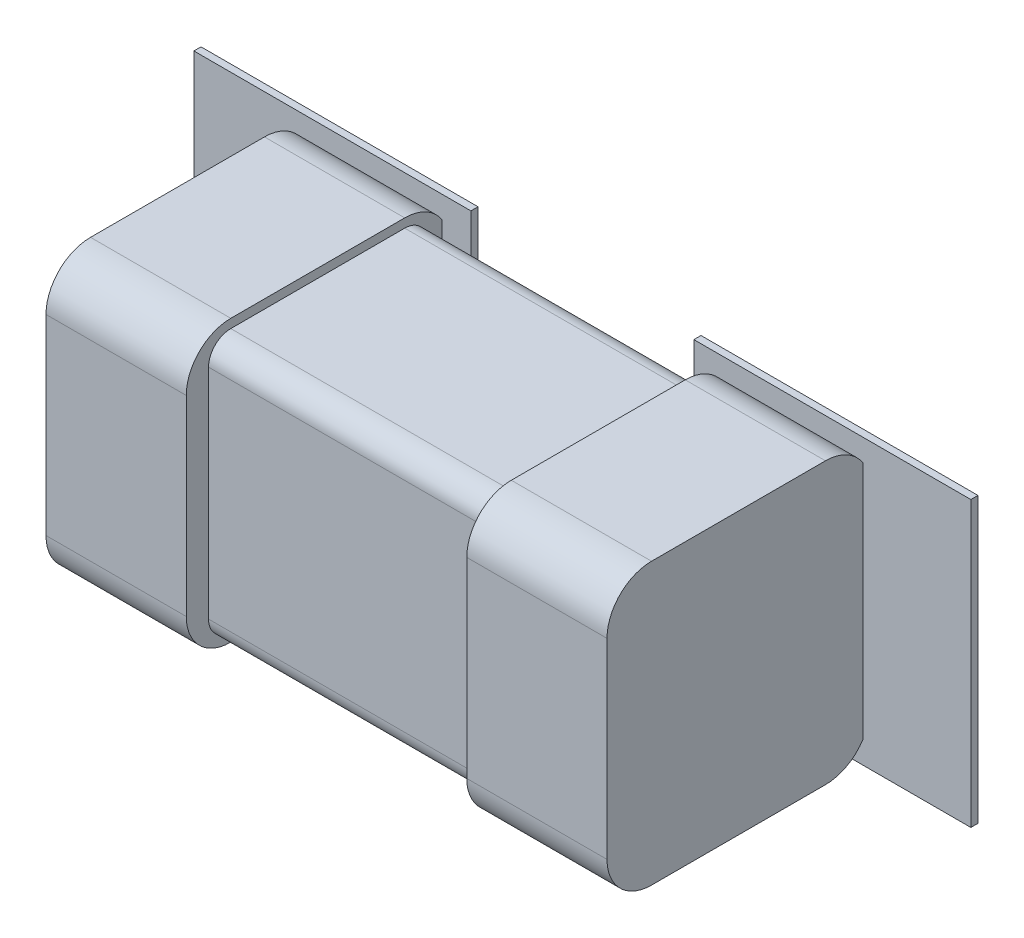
ISO-10303-21;
HEADER;
FILE_DESCRIPTION(('STEP AP214'),'2;1');
FILE_NAME('part.step','',(''),(''),'','','');
FILE_SCHEMA(('AUTOMOTIVE_DESIGN { 1 0 10303 214 1 1 1 1 }'));
ENDSEC;
DATA;
#1=APPLICATION_CONTEXT('core data for automotive mechanical design processes');
#2=APPLICATION_PROTOCOL_DEFINITION('international standard','automotive_design',2000,#1);
#3=PRODUCT_CONTEXT('',#1,'mechanical');
#4=PRODUCT('Part','Part','',(#3));
#5=PRODUCT_RELATED_PRODUCT_CATEGORY('part','',(#4));
#6=PRODUCT_DEFINITION_FORMATION('','',#4);
#7=PRODUCT_DEFINITION_CONTEXT('part definition',#1,'design');
#8=PRODUCT_DEFINITION('design','',#6,#7);
#9=PRODUCT_DEFINITION_SHAPE('','',#8);
#10=(LENGTH_UNIT() NAMED_UNIT(*) SI_UNIT(.MILLI.,.METRE.));
#11=(NAMED_UNIT(*) PLANE_ANGLE_UNIT() SI_UNIT($,.RADIAN.));
#12=(NAMED_UNIT(*) SI_UNIT($,.STERADIAN.) SOLID_ANGLE_UNIT());
#13=UNCERTAINTY_MEASURE_WITH_UNIT(LENGTH_MEASURE(1.E-05),#10,'distance_accuracy_value','');
#14=(GEOMETRIC_REPRESENTATION_CONTEXT(3) GLOBAL_UNCERTAINTY_ASSIGNED_CONTEXT((#13)) GLOBAL_UNIT_ASSIGNED_CONTEXT((#10,
#11,#12)) REPRESENTATION_CONTEXT('',''));
#15=CARTESIAN_POINT('',(0.,0.,0.));
#16=DIRECTION('',(0.,0.,1.));
#17=DIRECTION('',(1.,0.,0.));
#18=AXIS2_PLACEMENT_3D('',#15,#16,#17);
#19=CARTESIAN_POINT('',(0.,0.,0.0762));
#20=DIRECTION('',(0.,0.,1.));
#21=DIRECTION('',(1.,0.,0.));
#22=AXIS2_PLACEMENT_3D('',#19,#20,#21);
#23=PLANE('',#22);
#24=DIRECTION('',(0.,1.,0.));
#25=VECTOR('',#24,1.);
#26=CARTESIAN_POINT('',(-0.318008,-0.405003,0.0762));
#27=LINE('',#26,#25);
#28=CARTESIAN_POINT('',(-0.318008,-0.405003,0.0762));
#29=VERTEX_POINT('',#28);
#30=CARTESIAN_POINT('',(-0.318008,0.405003,0.0762));
#31=VERTEX_POINT('',#30);
#32=EDGE_CURVE('E282',#29,#31,#27,.T.);
#33=ORIENTED_EDGE('',*,*,#32,.F.);
#34=DIRECTION('',(1.,0.,0.));
#35=VECTOR('',#34,1.);
#36=CARTESIAN_POINT('',(-1.1079988,-0.405003,0.0762));
#37=LINE('',#36,#35);
#38=CARTESIAN_POINT('',(-1.1079988,-0.405003,0.0762));
#39=VERTEX_POINT('',#38);
#40=EDGE_CURVE('E287',#39,#29,#37,.T.);
#41=ORIENTED_EDGE('',*,*,#40,.F.);
#42=DIRECTION('',(0.,1.,0.));
#43=VECTOR('',#42,1.);
#44=CARTESIAN_POINT('',(-1.1079988,0.405003,0.0762));
#45=LINE('',#44,#43);
#46=CARTESIAN_POINT('',(-1.1079988,0.405003,0.0762));
#47=VERTEX_POINT('',#46);
#48=EDGE_CURVE('E259',#47,#39,#45,.F.);
#49=ORIENTED_EDGE('',*,*,#48,.F.);
#50=DIRECTION('',(1.,0.,0.));
#51=VECTOR('',#50,1.);
#52=CARTESIAN_POINT('',(-0.318008,0.405003,0.0762));
#53=LINE('',#52,#51);
#54=EDGE_CURVE('E277',#31,#47,#53,.F.);
#55=ORIENTED_EDGE('',*,*,#54,.F.);
#56=EDGE_LOOP('',(#33,#41,#49,#55));
#57=FACE_BOUND('',#56,.T.);
#58=ADVANCED_FACE('F16',(#57),#23,.F.);
#59=CARTESIAN_POINT('',(-1.1079988,-0.405003,0.0762));
#60=DIRECTION('',(0.,-1.,0.));
#61=DIRECTION('',(0.,0.,-1.));
#62=AXIS2_PLACEMENT_3D('',#59,#60,#61);
#63=PLANE('',#62);
#64=DIRECTION('',(0.,0.,1.));
#65=VECTOR('',#64,1.);
#66=CARTESIAN_POINT('',(-1.1079988,-0.405003,0.0762));
#67=LINE('',#66,#65);
#68=CARTESIAN_POINT('',(-1.1079988,-0.405003,0.09652));
#69=VERTEX_POINT('',#68);
#70=EDGE_CURVE('E275',#39,#69,#67,.T.);
#71=ORIENTED_EDGE('',*,*,#70,.F.);
#72=ORIENTED_EDGE('',*,*,#40,.T.);
#73=DIRECTION('',(0.,0.,-1.));
#74=VECTOR('',#73,1.);
#75=CARTESIAN_POINT('',(-0.318008,-0.405003,0.0762));
#76=LINE('',#75,#74);
#77=CARTESIAN_POINT('',(-0.318008,-0.405003,0.09652));
#78=VERTEX_POINT('',#77);
#79=EDGE_CURVE('E284',#78,#29,#76,.T.);
#80=ORIENTED_EDGE('',*,*,#79,.F.);
#81=DIRECTION('',(1.,0.,0.));
#82=VECTOR('',#81,1.);
#83=CARTESIAN_POINT('',(0.,-0.405003,0.09652));
#84=LINE('',#83,#82);
#85=EDGE_CURVE('E258',#69,#78,#84,.T.);
#86=ORIENTED_EDGE('',*,*,#85,.F.);
#87=EDGE_LOOP('',(#71,#72,#80,#86));
#88=FACE_BOUND('',#87,.T.);
#89=ADVANCED_FACE('F916',(#88),#63,.T.);
#90=CARTESIAN_POINT('',(-0.318008,-0.405003,0.0762));
#91=DIRECTION('',(1.,0.,0.));
#92=DIRECTION('',(0.,0.,-1.));
#93=AXIS2_PLACEMENT_3D('',#90,#91,#92);
#94=PLANE('',#93);
#95=ORIENTED_EDGE('',*,*,#79,.T.);
#96=ORIENTED_EDGE('',*,*,#32,.T.);
#97=DIRECTION('',(0.,0.,1.));
#98=VECTOR('',#97,1.);
#99=CARTESIAN_POINT('',(-0.318008,0.405003,0.0762));
#100=LINE('',#99,#98);
#101=CARTESIAN_POINT('',(-0.318008,0.405003,0.09652));
#102=VERTEX_POINT('',#101);
#103=EDGE_CURVE('E279',#102,#31,#100,.F.);
#104=ORIENTED_EDGE('',*,*,#103,.F.);
#105=DIRECTION('',(0.,1.,0.));
#106=VECTOR('',#105,1.);
#107=CARTESIAN_POINT('',(-0.318008,0.,0.09652));
#108=LINE('',#107,#106);
#109=EDGE_CURVE('E256',#78,#102,#108,.T.);
#110=ORIENTED_EDGE('',*,*,#109,.F.);
#111=EDGE_LOOP('',(#95,#96,#104,#110));
#112=FACE_BOUND('',#111,.T.);
#113=ADVANCED_FACE('F907',(#112),#94,.T.);
#114=CARTESIAN_POINT('',(-0.318008,0.405003,0.0762));
#115=DIRECTION('',(0.,1.,0.));
#116=DIRECTION('',(0.,0.,1.));
#117=AXIS2_PLACEMENT_3D('',#114,#115,#116);
#118=PLANE('',#117);
#119=ORIENTED_EDGE('',*,*,#103,.T.);
#120=ORIENTED_EDGE('',*,*,#54,.T.);
#121=DIRECTION('',(0.,0.,1.));
#122=VECTOR('',#121,1.);
#123=CARTESIAN_POINT('',(-1.1079988,0.405003,0.0762));
#124=LINE('',#123,#122);
#125=CARTESIAN_POINT('',(-1.1079988,0.405003,0.09652));
#126=VERTEX_POINT('',#125);
#127=EDGE_CURVE('E272',#126,#47,#124,.F.);
#128=ORIENTED_EDGE('',*,*,#127,.F.);
#129=DIRECTION('',(1.,0.,0.));
#130=VECTOR('',#129,1.);
#131=CARTESIAN_POINT('',(0.,0.405003,0.09652));
#132=LINE('',#131,#130);
#133=EDGE_CURVE('E254',#102,#126,#132,.F.);
#134=ORIENTED_EDGE('',*,*,#133,.F.);
#135=EDGE_LOOP('',(#119,#120,#128,#134));
#136=FACE_BOUND('',#135,.T.);
#137=ADVANCED_FACE('F898',(#136),#118,.T.);
#138=CARTESIAN_POINT('',(-1.1079988,0.405003,0.0762));
#139=DIRECTION('',(-1.,0.,0.));
#140=DIRECTION('',(0.,0.,1.));
#141=AXIS2_PLACEMENT_3D('',#138,#139,#140);
#142=PLANE('',#141);
#143=ORIENTED_EDGE('',*,*,#127,.T.);
#144=ORIENTED_EDGE('',*,*,#48,.T.);
#145=ORIENTED_EDGE('',*,*,#70,.T.);
#146=DIRECTION('',(0.,1.,0.));
#147=VECTOR('',#146,1.);
#148=CARTESIAN_POINT('',(-1.1079988,0.,0.09652));
#149=LINE('',#148,#147);
#150=EDGE_CURVE('E237',#126,#69,#149,.F.);
#151=ORIENTED_EDGE('',*,*,#150,.F.);
#152=EDGE_LOOP('',(#143,#144,#145,#151));
#153=FACE_BOUND('',#152,.T.);
#154=ADVANCED_FACE('F888',(#153),#142,.T.);
#155=CARTESIAN_POINT('',(-0.800000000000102,0.399999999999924,0.0762));
#156=DIRECTION('',(-1.,0.,0.));
#157=DIRECTION('',(0.,0.,1.));
#158=AXIS2_PLACEMENT_3D('',#155,#156,#157);
#159=PLANE('',#158);
#160=CARTESIAN_POINT('',(-0.800000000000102,0.272999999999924,0.2032));
#161=DIRECTION('',(1.,0.,0.));
#162=DIRECTION('',(0.,0.,-1.));
#163=AXIS2_PLACEMENT_3D('',#160,#161,#162);
#164=CIRCLE('',#163,0.127);
#165=CARTESIAN_POINT('',(-0.800000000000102,0.341908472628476,0.0965199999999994));
#166=VERTEX_POINT('',#165);
#167=CARTESIAN_POINT('',(-0.800000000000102,0.399999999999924,0.2032));
#168=VERTEX_POINT('',#167);
#169=EDGE_CURVE('E231',#166,#168,#164,.T.);
#170=ORIENTED_EDGE('',*,*,#169,.F.);
#171=DIRECTION('',(0.,1.,0.));
#172=VECTOR('',#171,1.);
#173=CARTESIAN_POINT('',(-0.800000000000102,0.,0.09652));
#174=LINE('',#173,#172);
#175=CARTESIAN_POINT('',(-0.800000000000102,-0.341908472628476,0.0965199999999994));
#176=VERTEX_POINT('',#175);
#177=EDGE_CURVE('E226',#176,#166,#174,.T.);
#178=ORIENTED_EDGE('',*,*,#177,.F.);
#179=CARTESIAN_POINT('',(-0.800000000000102,-0.272999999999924,0.2032));
#180=DIRECTION('',(1.,0.,0.));
#181=DIRECTION('',(0.,0.,-1.));
#182=AXIS2_PLACEMENT_3D('',#179,#180,#181);
#183=CIRCLE('',#182,0.127);
#184=CARTESIAN_POINT('',(-0.800000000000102,-0.399999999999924,0.2032));
#185=VERTEX_POINT('',#184);
#186=EDGE_CURVE('E19',#185,#176,#183,.T.);
#187=ORIENTED_EDGE('',*,*,#186,.F.);
#188=DIRECTION('',(0.,0.,-1.));
#189=VECTOR('',#188,1.);
#190=CARTESIAN_POINT('',(-0.800000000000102,-0.399999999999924,0.0762));
#191=LINE('',#190,#189);
#192=CARTESIAN_POINT('',(-0.800000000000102,-0.399999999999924,0.699262));
#193=VERTEX_POINT('',#192);
#194=EDGE_CURVE('E221',#193,#185,#191,.T.);
#195=ORIENTED_EDGE('',*,*,#194,.F.);
#196=CARTESIAN_POINT('',(-0.800000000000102,-0.272999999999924,0.699262));
#197=DIRECTION('',(1.,0.,0.));
#198=DIRECTION('',(0.,0.,-1.));
#199=AXIS2_PLACEMENT_3D('',#196,#197,#198);
#200=CIRCLE('',#199,0.127);
#201=CARTESIAN_POINT('',(-0.800000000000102,-0.272999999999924,0.826262));
#202=VERTEX_POINT('',#201);
#203=EDGE_CURVE('E368',#202,#193,#200,.T.);
#204=ORIENTED_EDGE('',*,*,#203,.F.);
#205=DIRECTION('',(0.,1.,0.));
#206=VECTOR('',#205,1.);
#207=CARTESIAN_POINT('',(-0.800000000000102,0.,0.826262));
#208=LINE('',#207,#206);
#209=CARTESIAN_POINT('',(-0.800000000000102,0.272999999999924,0.826262));
#210=VERTEX_POINT('',#209);
#211=EDGE_CURVE('E265',#210,#202,#208,.F.);
#212=ORIENTED_EDGE('',*,*,#211,.F.);
#213=CARTESIAN_POINT('',(-0.800000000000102,0.272999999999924,0.699262));
#214=DIRECTION('',(-1.,0.,0.));
#215=DIRECTION('',(0.,0.,1.));
#216=AXIS2_PLACEMENT_3D('',#213,#214,#215);
#217=CIRCLE('',#216,0.127);
#218=CARTESIAN_POINT('',(-0.800000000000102,0.399999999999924,0.699262));
#219=VERTEX_POINT('',#218);
#220=EDGE_CURVE('E264',#219,#210,#217,.F.);
#221=ORIENTED_EDGE('',*,*,#220,.F.);
#222=DIRECTION('',(0.,0.,1.));
#223=VECTOR('',#222,1.);
#224=CARTESIAN_POINT('',(-0.800000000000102,0.399999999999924,0.0762));
#225=LINE('',#224,#223);
#226=EDGE_CURVE('E261',#168,#219,#225,.T.);
#227=ORIENTED_EDGE('',*,*,#226,.F.);
#228=EDGE_LOOP('',(#170,#178,#187,#195,#204,#212,#221,#227));
#229=FACE_BOUND('',#228,.T.);
#230=ADVANCED_FACE('F228',(#229),#159,.T.);
#231=CARTESIAN_POINT('',(0.,0.,0.09652));
#232=DIRECTION('',(0.,0.,1.));
#233=DIRECTION('',(1.,0.,0.));
#234=AXIS2_PLACEMENT_3D('',#231,#232,#233);
#235=PLANE('',#234);
#236=DIRECTION('',(1.,0.,0.));
#237=VECTOR('',#236,1.);
#238=CARTESIAN_POINT('',(0.800000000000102,-0.341908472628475,0.0965199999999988));
#239=LINE('',#238,#237);
#240=CARTESIAN_POINT('',(-0.399999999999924,-0.341908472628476,0.0965199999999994));
#241=VERTEX_POINT('',#240);
#242=EDGE_CURVE('E236',#176,#241,#239,.T.);
#243=ORIENTED_EDGE('',*,*,#242,.F.);
#244=ORIENTED_EDGE('',*,*,#177,.T.);
#245=DIRECTION('',(1.,0.,0.));
#246=VECTOR('',#245,1.);
#247=CARTESIAN_POINT('',(0.800000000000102,0.341908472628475,0.0965199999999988));
#248=LINE('',#247,#246);
#249=CARTESIAN_POINT('',(-0.399999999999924,0.341908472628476,0.0965199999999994));
#250=VERTEX_POINT('',#249);
#251=EDGE_CURVE('E365',#250,#166,#248,.F.);
#252=ORIENTED_EDGE('',*,*,#251,.F.);
#253=DIRECTION('',(0.,1.,0.));
#254=VECTOR('',#253,1.);
#255=CARTESIAN_POINT('',(-0.399999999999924,0.399999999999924,0.09652));
#256=LINE('',#255,#254);
#257=EDGE_CURVE('E247',#250,#241,#256,.F.);
#258=ORIENTED_EDGE('',*,*,#257,.T.);
#259=EDGE_LOOP('',(#243,#244,#252,#258));
#260=FACE_BOUND('',#259,.T.);
#261=ORIENTED_EDGE('',*,*,#133,.T.);
#262=ORIENTED_EDGE('',*,*,#150,.T.);
#263=ORIENTED_EDGE('',*,*,#85,.T.);
#264=ORIENTED_EDGE('',*,*,#109,.T.);
#265=EDGE_LOOP('',(#261,#262,#263,#264));
#266=FACE_BOUND('',#265,.T.);
#267=ADVANCED_FACE('F245',(#260,#266),#235,.T.);
#268=CARTESIAN_POINT('',(0.800000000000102,-0.272999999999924,0.2032));
#269=DIRECTION('',(1.,0.,0.));
#270=DIRECTION('',(0.,0.,-1.));
#271=AXIS2_PLACEMENT_3D('',#268,#269,#270);
#272=CYLINDRICAL_SURFACE('',#271,0.127);
#273=DIRECTION('',(1.,0.,0.));
#274=VECTOR('',#273,1.);
#275=CARTESIAN_POINT('',(-0.800000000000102,-0.399999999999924,0.2032));
#276=LINE('',#275,#274);
#277=CARTESIAN_POINT('',(-0.399999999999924,-0.399999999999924,0.2032));
#278=VERTEX_POINT('',#277);
#279=EDGE_CURVE('E243',#185,#278,#276,.T.);
#280=ORIENTED_EDGE('',*,*,#279,.F.);
#281=ORIENTED_EDGE('',*,*,#186,.T.);
#282=ORIENTED_EDGE('',*,*,#242,.T.);
#283=CARTESIAN_POINT('',(-0.399999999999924,-0.272999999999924,0.2032));
#284=DIRECTION('',(1.,0.,0.));
#285=DIRECTION('',(0.,0.,-1.));
#286=AXIS2_PLACEMENT_3D('',#283,#284,#285);
#287=CIRCLE('',#286,0.127);
#288=EDGE_CURVE('E362',#241,#278,#287,.F.);
#289=ORIENTED_EDGE('',*,*,#288,.T.);
#290=EDGE_LOOP('',(#280,#281,#282,#289));
#291=FACE_BOUND('',#290,.T.);
#292=ADVANCED_FACE('F240',(#291),#272,.T.);
#293=CARTESIAN_POINT('',(-0.800000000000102,-0.399999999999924,0.0762));
#294=DIRECTION('',(0.,-1.,0.));
#295=DIRECTION('',(0.,0.,-1.));
#296=AXIS2_PLACEMENT_3D('',#293,#294,#295);
#297=PLANE('',#296);
#298=ORIENTED_EDGE('',*,*,#194,.T.);
#299=ORIENTED_EDGE('',*,*,#279,.T.);
#300=DIRECTION('',(0.,0.,1.));
#301=VECTOR('',#300,1.);
#302=CARTESIAN_POINT('',(-0.399999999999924,-0.399999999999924,0.826262));
#303=LINE('',#302,#301);
#304=CARTESIAN_POINT('',(-0.399999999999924,-0.399999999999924,0.699262));
#305=VERTEX_POINT('',#304);
#306=EDGE_CURVE('E361',#278,#305,#303,.T.);
#307=ORIENTED_EDGE('',*,*,#306,.T.);
#308=DIRECTION('',(1.,0.,0.));
#309=VECTOR('',#308,1.);
#310=CARTESIAN_POINT('',(-0.803806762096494,-0.399999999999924,0.699262));
#311=LINE('',#310,#309);
#312=EDGE_CURVE('E268',#193,#305,#311,.T.);
#313=ORIENTED_EDGE('',*,*,#312,.F.);
#314=EDGE_LOOP('',(#298,#299,#307,#313));
#315=FACE_BOUND('',#314,.T.);
#316=ADVANCED_FACE('F374',(#315),#297,.T.);
#317=CARTESIAN_POINT('',(-0.803806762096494,-0.272999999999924,0.699262));
#318=DIRECTION('',(1.,0.,0.));
#319=DIRECTION('',(0.,0.,-1.));
#320=AXIS2_PLACEMENT_3D('',#317,#318,#319);
#321=CYLINDRICAL_SURFACE('',#320,0.127);
#322=ORIENTED_EDGE('',*,*,#312,.T.);
#323=CARTESIAN_POINT('',(-0.399999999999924,-0.272999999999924,0.699262));
#324=DIRECTION('',(1.,0.,0.));
#325=DIRECTION('',(0.,0.,-1.));
#326=AXIS2_PLACEMENT_3D('',#323,#324,#325);
#327=CIRCLE('',#326,0.127);
#328=CARTESIAN_POINT('',(-0.399999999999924,-0.272999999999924,0.826262));
#329=VERTEX_POINT('',#328);
#330=EDGE_CURVE('E358',#305,#329,#327,.F.);
#331=ORIENTED_EDGE('',*,*,#330,.T.);
#332=DIRECTION('',(1.,0.,0.));
#333=VECTOR('',#332,1.);
#334=CARTESIAN_POINT('',(0.,-0.272999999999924,0.826262));
#335=LINE('',#334,#333);
#336=EDGE_CURVE('E267',#202,#329,#335,.T.);
#337=ORIENTED_EDGE('',*,*,#336,.F.);
#338=ORIENTED_EDGE('',*,*,#203,.T.);
#339=EDGE_LOOP('',(#322,#331,#337,#338));
#340=FACE_BOUND('',#339,.T.);
#341=ADVANCED_FACE('F401',(#340),#321,.T.);
#342=CARTESIAN_POINT('',(0.,0.,0.826262));
#343=DIRECTION('',(0.,0.,1.));
#344=DIRECTION('',(1.,0.,0.));
#345=AXIS2_PLACEMENT_3D('',#342,#343,#344);
#346=PLANE('',#345);
#347=DIRECTION('',(0.,1.,0.));
#348=VECTOR('',#347,1.);
#349=CARTESIAN_POINT('',(-0.399999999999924,0.399999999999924,0.826262));
#350=LINE('',#349,#348);
#351=CARTESIAN_POINT('',(-0.399999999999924,0.272999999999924,0.826262));
#352=VERTEX_POINT('',#351);
#353=EDGE_CURVE('E357',#329,#352,#350,.T.);
#354=ORIENTED_EDGE('',*,*,#353,.T.);
#355=DIRECTION('',(-1.,0.,0.));
#356=VECTOR('',#355,1.);
#357=CARTESIAN_POINT('',(0.80366030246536,0.272999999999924,0.826262));
#358=LINE('',#357,#356);
#359=EDGE_CURVE('E367',#210,#352,#358,.F.);
#360=ORIENTED_EDGE('',*,*,#359,.F.);
#361=ORIENTED_EDGE('',*,*,#211,.T.);
#362=ORIENTED_EDGE('',*,*,#336,.T.);
#363=EDGE_LOOP('',(#354,#360,#361,#362));
#364=FACE_BOUND('',#363,.T.);
#365=ADVANCED_FACE('F398',(#364),#346,.T.);
#366=CARTESIAN_POINT('',(0.80366030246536,0.272999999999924,0.699262));
#367=DIRECTION('',(-1.,0.,0.));
#368=DIRECTION('',(0.,0.,1.));
#369=AXIS2_PLACEMENT_3D('',#366,#367,#368);
#370=CYLINDRICAL_SURFACE('',#369,0.127);
#371=DIRECTION('',(1.,0.,0.));
#372=VECTOR('',#371,1.);
#373=CARTESIAN_POINT('',(0.800000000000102,0.399999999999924,0.699262));
#374=LINE('',#373,#372);
#375=CARTESIAN_POINT('',(-0.399999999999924,0.399999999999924,0.699262));
#376=VERTEX_POINT('',#375);
#377=EDGE_CURVE('E263',#219,#376,#374,.T.);
#378=ORIENTED_EDGE('',*,*,#377,.F.);
#379=ORIENTED_EDGE('',*,*,#220,.T.);
#380=ORIENTED_EDGE('',*,*,#359,.T.);
#381=CARTESIAN_POINT('',(-0.399999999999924,0.272999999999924,0.699262));
#382=DIRECTION('',(-1.,0.,0.));
#383=DIRECTION('',(0.,0.,1.));
#384=AXIS2_PLACEMENT_3D('',#381,#382,#383);
#385=CIRCLE('',#384,0.127);
#386=EDGE_CURVE('E354',#352,#376,#385,.T.);
#387=ORIENTED_EDGE('',*,*,#386,.T.);
#388=EDGE_LOOP('',(#378,#379,#380,#387));
#389=FACE_BOUND('',#388,.T.);
#390=ADVANCED_FACE('F409',(#389),#370,.T.);
#391=CARTESIAN_POINT('',(0.800000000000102,0.399999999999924,0.0762));
#392=DIRECTION('',(0.,1.,0.));
#393=DIRECTION('',(0.,0.,1.));
#394=AXIS2_PLACEMENT_3D('',#391,#392,#393);
#395=PLANE('',#394);
#396=DIRECTION('',(0.,0.,1.));
#397=VECTOR('',#396,1.);
#398=CARTESIAN_POINT('',(-0.399999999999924,0.399999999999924,0.826262));
#399=LINE('',#398,#397);
#400=CARTESIAN_POINT('',(-0.399999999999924,0.399999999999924,0.2032));
#401=VERTEX_POINT('',#400);
#402=EDGE_CURVE('E353',#376,#401,#399,.F.);
#403=ORIENTED_EDGE('',*,*,#402,.T.);
#404=DIRECTION('',(1.,0.,0.));
#405=VECTOR('',#404,1.);
#406=CARTESIAN_POINT('',(0.800000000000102,0.399999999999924,0.2032));
#407=LINE('',#406,#405);
#408=EDGE_CURVE('E391',#168,#401,#407,.T.);
#409=ORIENTED_EDGE('',*,*,#408,.F.);
#410=ORIENTED_EDGE('',*,*,#226,.T.);
#411=ORIENTED_EDGE('',*,*,#377,.T.);
#412=EDGE_LOOP('',(#403,#409,#410,#411));
#413=FACE_BOUND('',#412,.T.);
#414=ADVANCED_FACE('F513',(#413),#395,.T.);
#415=CARTESIAN_POINT('',(0.800000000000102,0.272999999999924,0.2032));
#416=DIRECTION('',(1.,0.,0.));
#417=DIRECTION('',(0.,0.,-1.));
#418=AXIS2_PLACEMENT_3D('',#415,#416,#417);
#419=CYLINDRICAL_SURFACE('',#418,0.127);
#420=ORIENTED_EDGE('',*,*,#251,.T.);
#421=ORIENTED_EDGE('',*,*,#169,.T.);
#422=ORIENTED_EDGE('',*,*,#408,.T.);
#423=CARTESIAN_POINT('',(-0.399999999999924,0.272999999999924,0.2032));
#424=DIRECTION('',(1.,0.,0.));
#425=DIRECTION('',(0.,0.,-1.));
#426=AXIS2_PLACEMENT_3D('',#423,#424,#425);
#427=CIRCLE('',#426,0.127);
#428=EDGE_CURVE('E350',#401,#250,#427,.F.);
#429=ORIENTED_EDGE('',*,*,#428,.T.);
#430=EDGE_LOOP('',(#420,#421,#422,#429));
#431=FACE_BOUND('',#430,.T.);
#432=ADVANCED_FACE('F509',(#431),#419,.T.);
#433=CARTESIAN_POINT('',(-0.399999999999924,0.399999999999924,0.826262));
#434=DIRECTION('',(-1.,0.,0.));
#435=DIRECTION('',(0.,0.,1.));
#436=AXIS2_PLACEMENT_3D('',#433,#434,#435);
#437=PLANE('',#436);
#438=DIRECTION('',(0.,1.,0.));
#439=VECTOR('',#438,1.);
#440=CARTESIAN_POINT('',(-0.399999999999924,0.374599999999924,0.1397));
#441=LINE('',#440,#439);
#442=CARTESIAN_POINT('',(-0.399999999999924,0.311099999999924,0.1397));
#443=VERTEX_POINT('',#442);
#444=CARTESIAN_POINT('',(-0.399999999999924,-0.311099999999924,0.1397));
#445=VERTEX_POINT('',#444);
#446=EDGE_CURVE('E341',#443,#445,#441,.F.);
#447=ORIENTED_EDGE('',*,*,#446,.T.);
#448=CARTESIAN_POINT('',(-0.399999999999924,-0.311099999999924,0.2032));
#449=DIRECTION('',(1.,0.,0.));
#450=DIRECTION('',(0.,0.,-1.));
#451=AXIS2_PLACEMENT_3D('',#448,#449,#450);
#452=CIRCLE('',#451,0.0635);
#453=CARTESIAN_POINT('',(-0.399999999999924,-0.374599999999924,0.2032));
#454=VERTEX_POINT('',#453);
#455=EDGE_CURVE('E338',#454,#445,#452,.T.);
#456=ORIENTED_EDGE('',*,*,#455,.F.);
#457=DIRECTION('',(0.,0.,1.));
#458=VECTOR('',#457,1.);
#459=CARTESIAN_POINT('',(-0.399999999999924,-0.374599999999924,0.826262));
#460=LINE('',#459,#458);
#461=CARTESIAN_POINT('',(-0.399999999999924,-0.374599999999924,0.699262));
#462=VERTEX_POINT('',#461);
#463=EDGE_CURVE('E337',#454,#462,#460,.T.);
#464=ORIENTED_EDGE('',*,*,#463,.T.);
#465=CARTESIAN_POINT('',(-0.399999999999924,-0.311099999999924,0.699262));
#466=DIRECTION('',(-1.,0.,0.));
#467=DIRECTION('',(0.,0.,1.));
#468=AXIS2_PLACEMENT_3D('',#465,#466,#467);
#469=CIRCLE('',#468,0.0635);
#470=CARTESIAN_POINT('',(-0.399999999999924,-0.311099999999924,0.762762));
#471=VERTEX_POINT('',#470);
#472=EDGE_CURVE('E334',#471,#462,#469,.F.);
#473=ORIENTED_EDGE('',*,*,#472,.F.);
#474=DIRECTION('',(0.,1.,0.));
#475=VECTOR('',#474,1.);
#476=CARTESIAN_POINT('',(-0.399999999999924,0.374599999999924,0.762762));
#477=LINE('',#476,#475);
#478=CARTESIAN_POINT('',(-0.399999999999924,0.311099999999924,0.762762));
#479=VERTEX_POINT('',#478);
#480=EDGE_CURVE('E349',#471,#479,#477,.T.);
#481=ORIENTED_EDGE('',*,*,#480,.T.);
#482=CARTESIAN_POINT('',(-0.399999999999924,0.311099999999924,0.699262));
#483=DIRECTION('',(1.,0.,0.));
#484=DIRECTION('',(0.,0.,-1.));
#485=AXIS2_PLACEMENT_3D('',#482,#483,#484);
#486=CIRCLE('',#485,0.0635);
#487=CARTESIAN_POINT('',(-0.399999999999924,0.374599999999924,0.699262));
#488=VERTEX_POINT('',#487);
#489=EDGE_CURVE('E346',#488,#479,#486,.T.);
#490=ORIENTED_EDGE('',*,*,#489,.F.);
#491=DIRECTION('',(0.,0.,-1.));
#492=VECTOR('',#491,1.);
#493=CARTESIAN_POINT('',(-0.399999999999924,0.374599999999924,0.826262));
#494=LINE('',#493,#492);
#495=CARTESIAN_POINT('',(-0.399999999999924,0.374599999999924,0.2032));
#496=VERTEX_POINT('',#495);
#497=EDGE_CURVE('E345',#488,#496,#494,.T.);
#498=ORIENTED_EDGE('',*,*,#497,.T.);
#499=CARTESIAN_POINT('',(-0.399999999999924,0.311099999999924,0.2032));
#500=DIRECTION('',(-1.,0.,0.));
#501=DIRECTION('',(0.,0.,1.));
#502=AXIS2_PLACEMENT_3D('',#499,#500,#501);
#503=CIRCLE('',#502,0.0635);
#504=EDGE_CURVE('E342',#443,#496,#503,.F.);
#505=ORIENTED_EDGE('',*,*,#504,.F.);
#506=EDGE_LOOP('',(#447,#456,#464,#473,#481,#490,#498,#505));
#507=FACE_BOUND('',#506,.T.);
#508=ORIENTED_EDGE('',*,*,#402,.F.);
#509=ORIENTED_EDGE('',*,*,#386,.F.);
#510=ORIENTED_EDGE('',*,*,#353,.F.);
#511=ORIENTED_EDGE('',*,*,#330,.F.);
#512=ORIENTED_EDGE('',*,*,#306,.F.);
#513=ORIENTED_EDGE('',*,*,#288,.F.);
#514=ORIENTED_EDGE('',*,*,#257,.F.);
#515=ORIENTED_EDGE('',*,*,#428,.F.);
#516=EDGE_LOOP('',(#508,#509,#510,#511,#512,#513,#514,#515));
#517=FACE_BOUND('',#516,.T.);
#518=ADVANCED_FACE('F378',(#507,#517),#437,.F.);
#519=CARTESIAN_POINT('',(0.399999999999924,0.374599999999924,0.762762));
#520=DIRECTION('',(0.,0.,-1.));
#521=DIRECTION('',(-1.,0.,0.));
#522=AXIS2_PLACEMENT_3D('',#519,#520,#521);
#523=PLANE('',#522);
#524=DIRECTION('',(-1.,0.,0.));
#525=VECTOR('',#524,1.);
#526=CARTESIAN_POINT('',(0.40380676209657,-0.311099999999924,0.762762));
#527=LINE('',#526,#525);
#528=CARTESIAN_POINT('',(0.399999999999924,-0.311099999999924,0.762762));
#529=VERTEX_POINT('',#528);
#530=EDGE_CURVE('E542',#529,#471,#527,.T.);
#531=ORIENTED_EDGE('',*,*,#530,.F.);
#532=DIRECTION('',(0.,1.,0.));
#533=VECTOR('',#532,1.);
#534=CARTESIAN_POINT('',(0.399999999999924,0.374599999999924,0.762762));
#535=LINE('',#534,#533);
#536=CARTESIAN_POINT('',(0.399999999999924,0.311099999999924,0.762762));
#537=VERTEX_POINT('',#536);
#538=EDGE_CURVE('E321',#529,#537,#535,.T.);
#539=ORIENTED_EDGE('',*,*,#538,.T.);
#540=DIRECTION('',(1.,0.,0.));
#541=VECTOR('',#540,1.);
#542=CARTESIAN_POINT('',(-0.403990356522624,0.311099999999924,0.762762));
#543=LINE('',#542,#541);
#544=EDGE_CURVE('E348',#479,#537,#543,.T.);
#545=ORIENTED_EDGE('',*,*,#544,.F.);
#546=ORIENTED_EDGE('',*,*,#480,.F.);
#547=EDGE_LOOP('',(#531,#539,#545,#546));
#548=FACE_BOUND('',#547,.T.);
#549=ADVANCED_FACE('F502',(#548),#523,.F.);
#550=CARTESIAN_POINT('',(-0.403990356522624,0.311099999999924,0.699262));
#551=DIRECTION('',(1.,0.,0.));
#552=DIRECTION('',(0.,0.,-1.));
#553=AXIS2_PLACEMENT_3D('',#550,#551,#552);
#554=CYLINDRICAL_SURFACE('',#553,0.0635);
#555=ORIENTED_EDGE('',*,*,#489,.T.);
#556=ORIENTED_EDGE('',*,*,#544,.T.);
#557=CARTESIAN_POINT('',(0.399999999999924,0.311099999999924,0.699262));
#558=DIRECTION('',(1.,0.,0.));
#559=DIRECTION('',(0.,0.,-1.));
#560=AXIS2_PLACEMENT_3D('',#557,#558,#559);
#561=CIRCLE('',#560,0.0635);
#562=CARTESIAN_POINT('',(0.399999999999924,0.374599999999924,0.699262));
#563=VERTEX_POINT('',#562);
#564=EDGE_CURVE('E318',#537,#563,#561,.F.);
#565=ORIENTED_EDGE('',*,*,#564,.T.);
#566=DIRECTION('',(1.,0.,0.));
#567=VECTOR('',#566,1.);
#568=CARTESIAN_POINT('',(-0.399999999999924,0.374599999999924,0.699262));
#569=LINE('',#568,#567);
#570=EDGE_CURVE('E390',#563,#488,#569,.F.);
#571=ORIENTED_EDGE('',*,*,#570,.T.);
#572=EDGE_LOOP('',(#555,#556,#565,#571));
#573=FACE_BOUND('',#572,.T.);
#574=ADVANCED_FACE('F498',(#573),#554,.T.);
#575=CARTESIAN_POINT('',(-0.399999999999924,0.374599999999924,0.826262));
#576=DIRECTION('',(0.,-1.,0.));
#577=DIRECTION('',(0.,0.,-1.));
#578=AXIS2_PLACEMENT_3D('',#575,#576,#577);
#579=PLANE('',#578);
#580=ORIENTED_EDGE('',*,*,#570,.F.);
#581=DIRECTION('',(0.,0.,-1.));
#582=VECTOR('',#581,1.);
#583=CARTESIAN_POINT('',(0.399999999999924,0.374599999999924,0.826262));
#584=LINE('',#583,#582);
#585=CARTESIAN_POINT('',(0.399999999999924,0.374599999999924,0.2032));
#586=VERTEX_POINT('',#585);
#587=EDGE_CURVE('E317',#563,#586,#584,.T.);
#588=ORIENTED_EDGE('',*,*,#587,.T.);
#589=DIRECTION('',(-1.,0.,0.));
#590=VECTOR('',#589,1.);
#591=CARTESIAN_POINT('',(0.403660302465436,0.374599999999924,0.2032));
#592=LINE('',#591,#590);
#593=EDGE_CURVE('E344',#496,#586,#592,.F.);
#594=ORIENTED_EDGE('',*,*,#593,.F.);
#595=ORIENTED_EDGE('',*,*,#497,.F.);
#596=EDGE_LOOP('',(#580,#588,#594,#595));
#597=FACE_BOUND('',#596,.T.);
#598=ADVANCED_FACE('F494',(#597),#579,.F.);
#599=CARTESIAN_POINT('',(0.403660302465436,0.311099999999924,0.2032));
#600=DIRECTION('',(-1.,0.,0.));
#601=DIRECTION('',(0.,0.,1.));
#602=AXIS2_PLACEMENT_3D('',#599,#600,#601);
#603=CYLINDRICAL_SURFACE('',#602,0.0635);
#604=CARTESIAN_POINT('',(0.399999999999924,0.311099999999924,0.2032));
#605=DIRECTION('',(-1.,0.,0.));
#606=DIRECTION('',(0.,0.,1.));
#607=AXIS2_PLACEMENT_3D('',#604,#605,#606);
#608=CIRCLE('',#607,0.0635);
#609=CARTESIAN_POINT('',(0.399999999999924,0.311099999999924,0.1397));
#610=VERTEX_POINT('',#609);
#611=EDGE_CURVE('E314',#586,#610,#608,.T.);
#612=ORIENTED_EDGE('',*,*,#611,.T.);
#613=DIRECTION('',(1.,0.,0.));
#614=VECTOR('',#613,1.);
#615=CARTESIAN_POINT('',(-0.399999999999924,0.311099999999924,0.1397));
#616=LINE('',#615,#614);
#617=EDGE_CURVE('E387',#610,#443,#616,.F.);
#618=ORIENTED_EDGE('',*,*,#617,.T.);
#619=ORIENTED_EDGE('',*,*,#504,.T.);
#620=ORIENTED_EDGE('',*,*,#593,.T.);
#621=EDGE_LOOP('',(#612,#618,#619,#620));
#622=FACE_BOUND('',#621,.T.);
#623=ADVANCED_FACE('F490',(#622),#603,.T.);
#624=CARTESIAN_POINT('',(-0.399999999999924,0.374599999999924,0.1397));
#625=DIRECTION('',(0.,0.,1.));
#626=DIRECTION('',(1.,0.,0.));
#627=AXIS2_PLACEMENT_3D('',#624,#625,#626);
#628=PLANE('',#627);
#629=DIRECTION('',(1.,0.,0.));
#630=VECTOR('',#629,1.);
#631=CARTESIAN_POINT('',(-0.403660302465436,-0.311099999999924,0.1397));
#632=LINE('',#631,#630);
#633=CARTESIAN_POINT('',(0.399999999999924,-0.311099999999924,0.1397));
#634=VERTEX_POINT('',#633);
#635=EDGE_CURVE('E340',#445,#634,#632,.T.);
#636=ORIENTED_EDGE('',*,*,#635,.F.);
#637=ORIENTED_EDGE('',*,*,#446,.F.);
#638=ORIENTED_EDGE('',*,*,#617,.F.);
#639=DIRECTION('',(0.,1.,0.));
#640=VECTOR('',#639,1.);
#641=CARTESIAN_POINT('',(0.399999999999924,0.374599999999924,0.1397));
#642=LINE('',#641,#640);
#643=EDGE_CURVE('E313',#610,#634,#642,.F.);
#644=ORIENTED_EDGE('',*,*,#643,.T.);
#645=EDGE_LOOP('',(#636,#637,#638,#644));
#646=FACE_BOUND('',#645,.T.);
#647=ADVANCED_FACE('F486',(#646),#628,.F.);
#648=CARTESIAN_POINT('',(-0.403660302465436,-0.311099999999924,0.2032));
#649=DIRECTION('',(1.,0.,0.));
#650=DIRECTION('',(0.,0.,-1.));
#651=AXIS2_PLACEMENT_3D('',#648,#649,#650);
#652=CYLINDRICAL_SURFACE('',#651,0.0635);
#653=ORIENTED_EDGE('',*,*,#455,.T.);
#654=ORIENTED_EDGE('',*,*,#635,.T.);
#655=CARTESIAN_POINT('',(0.399999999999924,-0.311099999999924,0.2032));
#656=DIRECTION('',(1.,0.,0.));
#657=DIRECTION('',(0.,0.,-1.));
#658=AXIS2_PLACEMENT_3D('',#655,#656,#657);
#659=CIRCLE('',#658,0.0635);
#660=CARTESIAN_POINT('',(0.399999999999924,-0.374599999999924,0.2032));
#661=VERTEX_POINT('',#660);
#662=EDGE_CURVE('E310',#634,#661,#659,.F.);
#663=ORIENTED_EDGE('',*,*,#662,.T.);
#664=DIRECTION('',(1.,0.,0.));
#665=VECTOR('',#664,1.);
#666=CARTESIAN_POINT('',(0.399999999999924,-0.374599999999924,0.2032));
#667=LINE('',#666,#665);
#668=EDGE_CURVE('E530',#661,#454,#667,.F.);
#669=ORIENTED_EDGE('',*,*,#668,.T.);
#670=EDGE_LOOP('',(#653,#654,#663,#669));
#671=FACE_BOUND('',#670,.T.);
#672=ADVANCED_FACE('F482',(#671),#652,.T.);
#673=CARTESIAN_POINT('',(0.399999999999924,-0.374599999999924,0.826262));
#674=DIRECTION('',(0.,1.,0.));
#675=DIRECTION('',(0.,0.,1.));
#676=AXIS2_PLACEMENT_3D('',#673,#674,#675);
#677=PLANE('',#676);
#678=ORIENTED_EDGE('',*,*,#668,.F.);
#679=DIRECTION('',(0.,0.,-1.));
#680=VECTOR('',#679,1.);
#681=CARTESIAN_POINT('',(0.399999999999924,-0.374599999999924,0.826262));
#682=LINE('',#681,#680);
#683=CARTESIAN_POINT('',(0.399999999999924,-0.374599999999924,0.699262));
#684=VERTEX_POINT('',#683);
#685=EDGE_CURVE('E309',#661,#684,#682,.F.);
#686=ORIENTED_EDGE('',*,*,#685,.T.);
#687=DIRECTION('',(-1.,0.,0.));
#688=VECTOR('',#687,1.);
#689=CARTESIAN_POINT('',(0.40380676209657,-0.374599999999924,0.699262));
#690=LINE('',#689,#688);
#691=EDGE_CURVE('E336',#462,#684,#690,.F.);
#692=ORIENTED_EDGE('',*,*,#691,.F.);
#693=ORIENTED_EDGE('',*,*,#463,.F.);
#694=EDGE_LOOP('',(#678,#686,#692,#693));
#695=FACE_BOUND('',#694,.T.);
#696=ADVANCED_FACE('F478',(#695),#677,.F.);
#697=CARTESIAN_POINT('',(0.40380676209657,-0.311099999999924,0.699262));
#698=DIRECTION('',(-1.,0.,0.));
#699=DIRECTION('',(0.,0.,1.));
#700=AXIS2_PLACEMENT_3D('',#697,#698,#699);
#701=CYLINDRICAL_SURFACE('',#700,0.0635);
#702=CARTESIAN_POINT('',(0.399999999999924,-0.311099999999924,0.699262));
#703=DIRECTION('',(-1.,0.,0.));
#704=DIRECTION('',(0.,0.,1.));
#705=AXIS2_PLACEMENT_3D('',#702,#703,#704);
#706=CIRCLE('',#705,0.0635);
#707=EDGE_CURVE('E306',#684,#529,#706,.T.);
#708=ORIENTED_EDGE('',*,*,#707,.T.);
#709=ORIENTED_EDGE('',*,*,#530,.T.);
#710=ORIENTED_EDGE('',*,*,#472,.T.);
#711=ORIENTED_EDGE('',*,*,#691,.T.);
#712=EDGE_LOOP('',(#708,#709,#710,#711));
#713=FACE_BOUND('',#712,.T.);
#714=ADVANCED_FACE('F474',(#713),#701,.T.);
#715=CARTESIAN_POINT('',(0.800000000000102,0.399999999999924,0.0762));
#716=DIRECTION('',(0.,1.,0.));
#717=DIRECTION('',(0.,0.,1.));
#718=AXIS2_PLACEMENT_3D('',#715,#716,#717);
#719=PLANE('',#718);
#720=DIRECTION('',(0.,0.,-1.));
#721=VECTOR('',#720,1.);
#722=CARTESIAN_POINT('',(0.800000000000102,0.399999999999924,0.0762));
#723=LINE('',#722,#721);
#724=CARTESIAN_POINT('',(0.800000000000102,0.399999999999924,0.2032));
#725=VERTEX_POINT('',#724);
#726=CARTESIAN_POINT('',(0.800000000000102,0.399999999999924,0.699262));
#727=VERTEX_POINT('',#726);
#728=EDGE_CURVE('E298',#725,#727,#723,.F.);
#729=ORIENTED_EDGE('',*,*,#728,.F.);
#730=DIRECTION('',(1.,0.,0.));
#731=VECTOR('',#730,1.);
#732=CARTESIAN_POINT('',(0.800000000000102,0.399999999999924,0.2032));
#733=LINE('',#732,#731);
#734=CARTESIAN_POINT('',(0.399999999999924,0.399999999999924,0.2032));
#735=VERTEX_POINT('',#734);
#736=EDGE_CURVE('E302',#735,#725,#733,.T.);
#737=ORIENTED_EDGE('',*,*,#736,.F.);
#738=DIRECTION('',(0.,0.,-1.));
#739=VECTOR('',#738,1.);
#740=CARTESIAN_POINT('',(0.399999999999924,0.399999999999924,0.826262));
#741=LINE('',#740,#739);
#742=CARTESIAN_POINT('',(0.399999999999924,0.399999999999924,0.699262));
#743=VERTEX_POINT('',#742);
#744=EDGE_CURVE('E333',#735,#743,#741,.F.);
#745=ORIENTED_EDGE('',*,*,#744,.T.);
#746=DIRECTION('',(-1.,0.,0.));
#747=VECTOR('',#746,1.);
#748=CARTESIAN_POINT('',(0.80366030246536,0.399999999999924,0.699262));
#749=LINE('',#748,#747);
#750=EDGE_CURVE('E545',#727,#743,#749,.T.);
#751=ORIENTED_EDGE('',*,*,#750,.F.);
#752=EDGE_LOOP('',(#729,#737,#745,#751));
#753=FACE_BOUND('',#752,.T.);
#754=ADVANCED_FACE('F470',(#753),#719,.T.);
#755=CARTESIAN_POINT('',(0.80366030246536,0.272999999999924,0.699262));
#756=DIRECTION('',(-1.,0.,0.));
#757=DIRECTION('',(0.,0.,1.));
#758=AXIS2_PLACEMENT_3D('',#755,#756,#757);
#759=CYLINDRICAL_SURFACE('',#758,0.127);
#760=ORIENTED_EDGE('',*,*,#750,.T.);
#761=CARTESIAN_POINT('',(0.399999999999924,0.272999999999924,0.699262));
#762=DIRECTION('',(-1.,0.,0.));
#763=DIRECTION('',(0.,0.,1.));
#764=AXIS2_PLACEMENT_3D('',#761,#762,#763);
#765=CIRCLE('',#764,0.127);
#766=CARTESIAN_POINT('',(0.399999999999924,0.272999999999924,0.826262));
#767=VERTEX_POINT('',#766);
#768=EDGE_CURVE('E330',#743,#767,#765,.F.);
#769=ORIENTED_EDGE('',*,*,#768,.T.);
#770=DIRECTION('',(1.,0.,0.));
#771=VECTOR('',#770,1.);
#772=CARTESIAN_POINT('',(0.,0.272999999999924,0.826262));
#773=LINE('',#772,#771);
#774=CARTESIAN_POINT('',(0.800000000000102,0.272999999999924,0.826262));
#775=VERTEX_POINT('',#774);
#776=EDGE_CURVE('E549',#775,#767,#773,.F.);
#777=ORIENTED_EDGE('',*,*,#776,.F.);
#778=CARTESIAN_POINT('',(0.800000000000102,0.272999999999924,0.699262));
#779=DIRECTION('',(-1.,0.,0.));
#780=DIRECTION('',(0.,0.,1.));
#781=AXIS2_PLACEMENT_3D('',#778,#779,#780);
#782=CIRCLE('',#781,0.127);
#783=EDGE_CURVE('E296',#727,#775,#782,.F.);
#784=ORIENTED_EDGE('',*,*,#783,.F.);
#785=EDGE_LOOP('',(#760,#769,#777,#784));
#786=FACE_BOUND('',#785,.T.);
#787=ADVANCED_FACE('F466',(#786),#759,.T.);
#788=CARTESIAN_POINT('',(0.,0.,0.826262));
#789=DIRECTION('',(0.,0.,1.));
#790=DIRECTION('',(1.,0.,0.));
#791=AXIS2_PLACEMENT_3D('',#788,#789,#790);
#792=PLANE('',#791);
#793=DIRECTION('',(0.,1.,0.));
#794=VECTOR('',#793,1.);
#795=CARTESIAN_POINT('',(0.800000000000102,-0.399999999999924,0.826262));
#796=LINE('',#795,#794);
#797=CARTESIAN_POINT('',(0.800000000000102,-0.272999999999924,0.826262));
#798=VERTEX_POINT('',#797);
#799=EDGE_CURVE('E295',#775,#798,#796,.F.);
#800=ORIENTED_EDGE('',*,*,#799,.F.);
#801=ORIENTED_EDGE('',*,*,#776,.T.);
#802=DIRECTION('',(0.,1.,0.));
#803=VECTOR('',#802,1.);
#804=CARTESIAN_POINT('',(0.399999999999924,0.374599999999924,0.826262));
#805=LINE('',#804,#803);
#806=CARTESIAN_POINT('',(0.399999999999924,-0.272999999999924,0.826262));
#807=VERTEX_POINT('',#806);
#808=EDGE_CURVE('E329',#767,#807,#805,.F.);
#809=ORIENTED_EDGE('',*,*,#808,.T.);
#810=DIRECTION('',(1.,0.,0.));
#811=VECTOR('',#810,1.);
#812=CARTESIAN_POINT('',(-0.803806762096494,-0.272999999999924,0.826262));
#813=LINE('',#812,#811);
#814=EDGE_CURVE('E551',#798,#807,#813,.F.);
#815=ORIENTED_EDGE('',*,*,#814,.F.);
#816=EDGE_LOOP('',(#800,#801,#809,#815));
#817=FACE_BOUND('',#816,.T.);
#818=ADVANCED_FACE('F462',(#817),#792,.T.);
#819=CARTESIAN_POINT('',(-0.803806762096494,-0.272999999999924,0.699262));
#820=DIRECTION('',(1.,0.,0.));
#821=DIRECTION('',(0.,0.,-1.));
#822=AXIS2_PLACEMENT_3D('',#819,#820,#821);
#823=CYLINDRICAL_SURFACE('',#822,0.127);
#824=DIRECTION('',(1.,0.,0.));
#825=VECTOR('',#824,1.);
#826=CARTESIAN_POINT('',(-0.800000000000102,-0.399999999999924,0.699262));
#827=LINE('',#826,#825);
#828=CARTESIAN_POINT('',(0.800000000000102,-0.399999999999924,0.699262));
#829=VERTEX_POINT('',#828);
#830=CARTESIAN_POINT('',(0.399999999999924,-0.399999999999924,0.699262));
#831=VERTEX_POINT('',#830);
#832=EDGE_CURVE('E553',#829,#831,#827,.F.);
#833=ORIENTED_EDGE('',*,*,#832,.F.);
#834=CARTESIAN_POINT('',(0.800000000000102,-0.272999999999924,0.699262));
#835=DIRECTION('',(1.,0.,0.));
#836=DIRECTION('',(0.,0.,-1.));
#837=AXIS2_PLACEMENT_3D('',#834,#835,#836);
#838=CIRCLE('',#837,0.127);
#839=EDGE_CURVE('E293',#798,#829,#838,.T.);
#840=ORIENTED_EDGE('',*,*,#839,.F.);
#841=ORIENTED_EDGE('',*,*,#814,.T.);
#842=CARTESIAN_POINT('',(0.399999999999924,-0.272999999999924,0.699262));
#843=DIRECTION('',(1.,0.,0.));
#844=DIRECTION('',(0.,0.,-1.));
#845=AXIS2_PLACEMENT_3D('',#842,#843,#844);
#846=CIRCLE('',#845,0.127);
#847=EDGE_CURVE('E326',#807,#831,#846,.T.);
#848=ORIENTED_EDGE('',*,*,#847,.T.);
#849=EDGE_LOOP('',(#833,#840,#841,#848));
#850=FACE_BOUND('',#849,.T.);
#851=ADVANCED_FACE('F458',(#850),#823,.T.);
#852=CARTESIAN_POINT('',(-0.800000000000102,-0.399999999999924,0.0762));
#853=DIRECTION('',(0.,-1.,0.));
#854=DIRECTION('',(0.,0.,-1.));
#855=AXIS2_PLACEMENT_3D('',#852,#853,#854);
#856=PLANE('',#855);
#857=DIRECTION('',(0.,0.,-1.));
#858=VECTOR('',#857,1.);
#859=CARTESIAN_POINT('',(0.399999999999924,-0.399999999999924,0.826262));
#860=LINE('',#859,#858);
#861=CARTESIAN_POINT('',(0.399999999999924,-0.399999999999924,0.2032));
#862=VERTEX_POINT('',#861);
#863=EDGE_CURVE('E325',#831,#862,#860,.T.);
#864=ORIENTED_EDGE('',*,*,#863,.T.);
#865=DIRECTION('',(1.,0.,0.));
#866=VECTOR('',#865,1.);
#867=CARTESIAN_POINT('',(0.800000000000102,-0.399999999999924,0.2032));
#868=LINE('',#867,#866);
#869=CARTESIAN_POINT('',(0.800000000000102,-0.399999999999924,0.2032));
#870=VERTEX_POINT('',#869);
#871=EDGE_CURVE('E555',#870,#862,#868,.F.);
#872=ORIENTED_EDGE('',*,*,#871,.F.);
#873=DIRECTION('',(0.,0.,-1.));
#874=VECTOR('',#873,1.);
#875=CARTESIAN_POINT('',(0.800000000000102,-0.399999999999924,0.0762));
#876=LINE('',#875,#874);
#877=EDGE_CURVE('E292',#829,#870,#876,.T.);
#878=ORIENTED_EDGE('',*,*,#877,.F.);
#879=ORIENTED_EDGE('',*,*,#832,.T.);
#880=EDGE_LOOP('',(#864,#872,#878,#879));
#881=FACE_BOUND('',#880,.T.);
#882=ADVANCED_FACE('F454',(#881),#856,.T.);
#883=CARTESIAN_POINT('',(0.800000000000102,-0.272999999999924,0.2032));
#884=DIRECTION('',(1.,0.,0.));
#885=DIRECTION('',(0.,0.,-1.));
#886=AXIS2_PLACEMENT_3D('',#883,#884,#885);
#887=CYLINDRICAL_SURFACE('',#886,0.127);
#888=DIRECTION('',(1.,0.,0.));
#889=VECTOR('',#888,1.);
#890=CARTESIAN_POINT('',(0.,-0.341908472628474,0.09652));
#891=LINE('',#890,#889);
#892=CARTESIAN_POINT('',(0.800000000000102,-0.341908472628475,0.09652));
#893=VERTEX_POINT('',#892);
#894=CARTESIAN_POINT('',(0.399999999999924,-0.341908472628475,0.09652));
#895=VERTEX_POINT('',#894);
#896=EDGE_CURVE('E291',#893,#895,#891,.F.);
#897=ORIENTED_EDGE('',*,*,#896,.F.);
#898=CARTESIAN_POINT('',(0.800000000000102,-0.272999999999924,0.2032));
#899=DIRECTION('',(1.,0.,0.));
#900=DIRECTION('',(0.,0.,-1.));
#901=AXIS2_PLACEMENT_3D('',#898,#899,#900);
#902=CIRCLE('',#901,0.127);
#903=EDGE_CURVE('E289',#870,#893,#902,.T.);
#904=ORIENTED_EDGE('',*,*,#903,.F.);
#905=ORIENTED_EDGE('',*,*,#871,.T.);
#906=CARTESIAN_POINT('',(0.399999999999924,-0.272999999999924,0.2032));
#907=DIRECTION('',(1.,0.,0.));
#908=DIRECTION('',(0.,0.,-1.));
#909=AXIS2_PLACEMENT_3D('',#906,#907,#908);
#910=CIRCLE('',#909,0.127);
#911=EDGE_CURVE('E322',#862,#895,#910,.T.);
#912=ORIENTED_EDGE('',*,*,#911,.T.);
#913=EDGE_LOOP('',(#897,#904,#905,#912));
#914=FACE_BOUND('',#913,.T.);
#915=ADVANCED_FACE('F450',(#914),#887,.T.);
#916=CARTESIAN_POINT('',(0.399999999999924,0.374599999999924,0.826262));
#917=DIRECTION('',(1.,0.,0.));
#918=DIRECTION('',(0.,0.,-1.));
#919=AXIS2_PLACEMENT_3D('',#916,#917,#918);
#920=PLANE('',#919);
#921=ORIENTED_EDGE('',*,*,#685,.F.);
#922=ORIENTED_EDGE('',*,*,#662,.F.);
#923=ORIENTED_EDGE('',*,*,#643,.F.);
#924=ORIENTED_EDGE('',*,*,#611,.F.);
#925=ORIENTED_EDGE('',*,*,#587,.F.);
#926=ORIENTED_EDGE('',*,*,#564,.F.);
#927=ORIENTED_EDGE('',*,*,#538,.F.);
#928=ORIENTED_EDGE('',*,*,#707,.F.);
#929=EDGE_LOOP('',(#921,#922,#923,#924,#925,#926,#927,#928));
#930=FACE_BOUND('',#929,.T.);
#931=ORIENTED_EDGE('',*,*,#863,.F.);
#932=ORIENTED_EDGE('',*,*,#847,.F.);
#933=ORIENTED_EDGE('',*,*,#808,.F.);
#934=ORIENTED_EDGE('',*,*,#768,.F.);
#935=ORIENTED_EDGE('',*,*,#744,.F.);
#936=CARTESIAN_POINT('',(0.399999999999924,0.272999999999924,0.2032));
#937=DIRECTION('',(1.,0.,0.));
#938=DIRECTION('',(0.,0.,-1.));
#939=AXIS2_PLACEMENT_3D('',#936,#937,#938);
#940=CIRCLE('',#939,0.127);
#941=CARTESIAN_POINT('',(0.399999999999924,0.341908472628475,0.09652));
#942=VERTEX_POINT('',#941);
#943=EDGE_CURVE('E303',#942,#735,#940,.T.);
#944=ORIENTED_EDGE('',*,*,#943,.F.);
#945=DIRECTION('',(0.,1.,0.));
#946=VECTOR('',#945,1.);
#947=CARTESIAN_POINT('',(0.399999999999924,0.,0.09652));
#948=LINE('',#947,#946);
#949=EDGE_CURVE('E571',#895,#942,#948,.T.);
#950=ORIENTED_EDGE('',*,*,#949,.F.);
#951=ORIENTED_EDGE('',*,*,#911,.F.);
#952=EDGE_LOOP('',(#931,#932,#933,#934,#935,#944,#950,#951));
#953=FACE_BOUND('',#952,.T.);
#954=ADVANCED_FACE('F446',(#930,#953),#920,.F.);
#955=CARTESIAN_POINT('',(0.800000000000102,0.272999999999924,0.2032));
#956=DIRECTION('',(1.,0.,0.));
#957=DIRECTION('',(0.,0.,-1.));
#958=AXIS2_PLACEMENT_3D('',#955,#956,#957);
#959=CYLINDRICAL_SURFACE('',#958,0.127);
#960=ORIENTED_EDGE('',*,*,#736,.T.);
#961=CARTESIAN_POINT('',(0.800000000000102,0.272999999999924,0.2032));
#962=DIRECTION('',(1.,0.,0.));
#963=DIRECTION('',(0.,0.,-1.));
#964=AXIS2_PLACEMENT_3D('',#961,#962,#963);
#965=CIRCLE('',#964,0.127);
#966=CARTESIAN_POINT('',(0.800000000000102,0.341908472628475,0.09652));
#967=VERTEX_POINT('',#966);
#968=EDGE_CURVE('E299',#967,#725,#965,.T.);
#969=ORIENTED_EDGE('',*,*,#968,.F.);
#970=DIRECTION('',(1.,0.,0.));
#971=VECTOR('',#970,1.);
#972=CARTESIAN_POINT('',(0.,0.341908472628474,0.09652));
#973=LINE('',#972,#971);
#974=EDGE_CURVE('E573',#942,#967,#973,.T.);
#975=ORIENTED_EDGE('',*,*,#974,.F.);
#976=ORIENTED_EDGE('',*,*,#943,.T.);
#977=EDGE_LOOP('',(#960,#969,#975,#976));
#978=FACE_BOUND('',#977,.T.);
#979=ADVANCED_FACE('F442',(#978),#959,.T.);
#980=CARTESIAN_POINT('',(0.800000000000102,-0.399999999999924,0.0762));
#981=DIRECTION('',(1.,0.,0.));
#982=DIRECTION('',(0.,0.,-1.));
#983=AXIS2_PLACEMENT_3D('',#980,#981,#982);
#984=PLANE('',#983);
#985=ORIENTED_EDGE('',*,*,#903,.T.);
#986=DIRECTION('',(0.,1.,0.));
#987=VECTOR('',#986,1.);
#988=CARTESIAN_POINT('',(0.800000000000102,0.,0.09652));
#989=LINE('',#988,#987);
#990=EDGE_CURVE('E575',#967,#893,#989,.F.);
#991=ORIENTED_EDGE('',*,*,#990,.F.);
#992=ORIENTED_EDGE('',*,*,#968,.T.);
#993=ORIENTED_EDGE('',*,*,#728,.T.);
#994=ORIENTED_EDGE('',*,*,#783,.T.);
#995=ORIENTED_EDGE('',*,*,#799,.T.);
#996=ORIENTED_EDGE('',*,*,#839,.T.);
#997=ORIENTED_EDGE('',*,*,#877,.T.);
#998=EDGE_LOOP('',(#985,#991,#992,#993,#994,#995,#996,#997));
#999=FACE_BOUND('',#998,.T.);
#1000=ADVANCED_FACE('F438',(#999),#984,.T.);
#1001=CARTESIAN_POINT('',(0.,0.,0.09652));
#1002=DIRECTION('',(0.,0.,1.));
#1003=DIRECTION('',(1.,0.,0.));
#1004=AXIS2_PLACEMENT_3D('',#1001,#1002,#1003);
#1005=PLANE('',#1004);
#1006=ORIENTED_EDGE('',*,*,#974,.T.);
#1007=ORIENTED_EDGE('',*,*,#990,.T.);
#1008=ORIENTED_EDGE('',*,*,#896,.T.);
#1009=ORIENTED_EDGE('',*,*,#949,.T.);
#1010=EDGE_LOOP('',(#1006,#1007,#1008,#1009));
#1011=FACE_BOUND('',#1010,.T.);
#1012=DIRECTION('',(1.,0.,0.));
#1013=VECTOR('',#1012,1.);
#1014=CARTESIAN_POINT('',(0.318008,-0.405003,0.09652));
#1015=LINE('',#1014,#1013);
#1016=CARTESIAN_POINT('',(1.1079988,-0.405003,0.09652));
#1017=VERTEX_POINT('',#1016);
#1018=CARTESIAN_POINT('',(0.318008,-0.405003,0.09652));
#1019=VERTEX_POINT('',#1018);
#1020=EDGE_CURVE('E595',#1017,#1019,#1015,.F.);
#1021=ORIENTED_EDGE('',*,*,#1020,.F.);
#1022=DIRECTION('',(0.,1.,0.));
#1023=VECTOR('',#1022,1.);
#1024=CARTESIAN_POINT('',(1.1079988,-0.405003,0.09652));
#1025=LINE('',#1024,#1023);
#1026=CARTESIAN_POINT('',(1.1079988,0.405003,0.09652));
#1027=VERTEX_POINT('',#1026);
#1028=EDGE_CURVE('E578',#1027,#1017,#1025,.F.);
#1029=ORIENTED_EDGE('',*,*,#1028,.F.);
#1030=DIRECTION('',(1.,0.,0.));
#1031=VECTOR('',#1030,1.);
#1032=CARTESIAN_POINT('',(1.1079988,0.405003,0.09652));
#1033=LINE('',#1032,#1031);
#1034=CARTESIAN_POINT('',(0.318008,0.405003,0.09652));
#1035=VERTEX_POINT('',#1034);
#1036=EDGE_CURVE('E584',#1035,#1027,#1033,.T.);
#1037=ORIENTED_EDGE('',*,*,#1036,.F.);
#1038=DIRECTION('',(0.,1.,0.));
#1039=VECTOR('',#1038,1.);
#1040=CARTESIAN_POINT('',(0.318008,0.405003,0.09652));
#1041=LINE('',#1040,#1039);
#1042=EDGE_CURVE('E588',#1019,#1035,#1041,.T.);
#1043=ORIENTED_EDGE('',*,*,#1042,.F.);
#1044=EDGE_LOOP('',(#1021,#1029,#1037,#1043));
#1045=FACE_BOUND('',#1044,.T.);
#1046=ADVANCED_FACE('F434',(#1011,#1045),#1005,.T.);
#1047=CARTESIAN_POINT('',(1.1079988,-0.405003,0.0762));
#1048=DIRECTION('',(1.,0.,0.));
#1049=DIRECTION('',(0.,0.,-1.));
#1050=AXIS2_PLACEMENT_3D('',#1047,#1048,#1049);
#1051=PLANE('',#1050);
#1052=DIRECTION('',(0.,0.,-1.));
#1053=VECTOR('',#1052,1.);
#1054=CARTESIAN_POINT('',(1.1079988,-0.405003,0.0762));
#1055=LINE('',#1054,#1053);
#1056=CARTESIAN_POINT('',(1.1079988,-0.405003,0.0762));
#1057=VERTEX_POINT('',#1056);
#1058=EDGE_CURVE('E592',#1057,#1017,#1055,.F.);
#1059=ORIENTED_EDGE('',*,*,#1058,.F.);
#1060=DIRECTION('',(0.,1.,0.));
#1061=VECTOR('',#1060,1.);
#1062=CARTESIAN_POINT('',(1.1079988,0.,0.0762));
#1063=LINE('',#1062,#1061);
#1064=CARTESIAN_POINT('',(1.1079988,0.405003,0.0762));
#1065=VERTEX_POINT('',#1064);
#1066=EDGE_CURVE('E598',#1057,#1065,#1063,.T.);
#1067=ORIENTED_EDGE('',*,*,#1066,.T.);
#1068=DIRECTION('',(0.,0.,1.));
#1069=VECTOR('',#1068,1.);
#1070=CARTESIAN_POINT('',(1.1079988,0.405003,0.0762));
#1071=LINE('',#1070,#1069);
#1072=EDGE_CURVE('E586',#1027,#1065,#1071,.F.);
#1073=ORIENTED_EDGE('',*,*,#1072,.F.);
#1074=ORIENTED_EDGE('',*,*,#1028,.T.);
#1075=EDGE_LOOP('',(#1059,#1067,#1073,#1074));
#1076=FACE_BOUND('',#1075,.T.);
#1077=ADVANCED_FACE('F430',(#1076),#1051,.T.);
#1078=CARTESIAN_POINT('',(1.1079988,0.405003,0.0762));
#1079=DIRECTION('',(0.,1.,0.));
#1080=DIRECTION('',(0.,0.,1.));
#1081=AXIS2_PLACEMENT_3D('',#1078,#1079,#1080);
#1082=PLANE('',#1081);
#1083=ORIENTED_EDGE('',*,*,#1072,.T.);
#1084=DIRECTION('',(1.,0.,0.));
#1085=VECTOR('',#1084,1.);
#1086=CARTESIAN_POINT('',(0.,0.405003,0.0762));
#1087=LINE('',#1086,#1085);
#1088=CARTESIAN_POINT('',(0.318008,0.405003,0.0762));
#1089=VERTEX_POINT('',#1088);
#1090=EDGE_CURVE('E601',#1065,#1089,#1087,.F.);
#1091=ORIENTED_EDGE('',*,*,#1090,.T.);
#1092=DIRECTION('',(0.,0.,1.));
#1093=VECTOR('',#1092,1.);
#1094=CARTESIAN_POINT('',(0.318008,0.405003,0.0762));
#1095=LINE('',#1094,#1093);
#1096=EDGE_CURVE('E590',#1035,#1089,#1095,.F.);
#1097=ORIENTED_EDGE('',*,*,#1096,.F.);
#1098=ORIENTED_EDGE('',*,*,#1036,.T.);
#1099=EDGE_LOOP('',(#1083,#1091,#1097,#1098));
#1100=FACE_BOUND('',#1099,.T.);
#1101=ADVANCED_FACE('F426',(#1100),#1082,.T.);
#1102=CARTESIAN_POINT('',(0.318008,0.405003,0.0762));
#1103=DIRECTION('',(-1.,0.,0.));
#1104=DIRECTION('',(0.,0.,1.));
#1105=AXIS2_PLACEMENT_3D('',#1102,#1103,#1104);
#1106=PLANE('',#1105);
#1107=ORIENTED_EDGE('',*,*,#1096,.T.);
#1108=DIRECTION('',(0.,1.,0.));
#1109=VECTOR('',#1108,1.);
#1110=CARTESIAN_POINT('',(0.318008,0.,0.0762));
#1111=LINE('',#1110,#1109);
#1112=CARTESIAN_POINT('',(0.318008,-0.405003,0.0762));
#1113=VERTEX_POINT('',#1112);
#1114=EDGE_CURVE('E25',#1089,#1113,#1111,.F.);
#1115=ORIENTED_EDGE('',*,*,#1114,.T.);
#1116=DIRECTION('',(0.,0.,-1.));
#1117=VECTOR('',#1116,1.);
#1118=CARTESIAN_POINT('',(0.318008,-0.405003,0.0762));
#1119=LINE('',#1118,#1117);
#1120=EDGE_CURVE('E33',#1019,#1113,#1119,.T.);
#1121=ORIENTED_EDGE('',*,*,#1120,.F.);
#1122=ORIENTED_EDGE('',*,*,#1042,.T.);
#1123=EDGE_LOOP('',(#1107,#1115,#1121,#1122));
#1124=FACE_BOUND('',#1123,.T.);
#1125=ADVANCED_FACE('F420',(#1124),#1106,.T.);
#1126=CARTESIAN_POINT('',(0.318008,-0.405003,0.0762));
#1127=DIRECTION('',(0.,-1.,0.));
#1128=DIRECTION('',(0.,0.,-1.));
#1129=AXIS2_PLACEMENT_3D('',#1126,#1127,#1128);
#1130=PLANE('',#1129);
#1131=ORIENTED_EDGE('',*,*,#1120,.T.);
#1132=DIRECTION('',(1.,0.,0.));
#1133=VECTOR('',#1132,1.);
#1134=CARTESIAN_POINT('',(0.,-0.405003,0.0762));
#1135=LINE('',#1134,#1133);
#1136=EDGE_CURVE('E11',#1113,#1057,#1135,.T.);
#1137=ORIENTED_EDGE('',*,*,#1136,.T.);
#1138=ORIENTED_EDGE('',*,*,#1058,.T.);
#1139=ORIENTED_EDGE('',*,*,#1020,.T.);
#1140=EDGE_LOOP('',(#1131,#1137,#1138,#1139));
#1141=FACE_BOUND('',#1140,.T.);
#1142=ADVANCED_FACE('F414',(#1141),#1130,.T.);
#1143=CARTESIAN_POINT('',(0.,0.,0.0762));
#1144=DIRECTION('',(0.,0.,1.));
#1145=DIRECTION('',(1.,0.,0.));
#1146=AXIS2_PLACEMENT_3D('',#1143,#1144,#1145);
#1147=PLANE('',#1146);
#1148=ORIENTED_EDGE('',*,*,#1114,.F.);
#1149=ORIENTED_EDGE('',*,*,#1090,.F.);
#1150=ORIENTED_EDGE('',*,*,#1066,.F.);
#1151=ORIENTED_EDGE('',*,*,#1136,.F.);
#1152=EDGE_LOOP('',(#1148,#1149,#1150,#1151));
#1153=FACE_BOUND('',#1152,.T.);
#1154=ADVANCED_FACE('F412',(#1153),#1147,.F.);
#1155=CLOSED_SHELL('',(#58,#89,#113,#137,#154,#230,#267,#292,#316,#341,#365,#390,#414,#432,#518,
#549,#574,#598,#623,#647,#672,#696,#714,#754,#787,#818,#851,#882,#915,#954,#979,#1000,#1046,
#1077,#1101,#1125,#1142,#1154));
#1156=MANIFOLD_SOLID_BREP('B1',#1155);
#1157=ADVANCED_BREP_SHAPE_REPRESENTATION('',(#18,#1156),#14);
#1158=SHAPE_DEFINITION_REPRESENTATION(#9,#1157);
ENDSEC;
END-ISO-10303-21;
